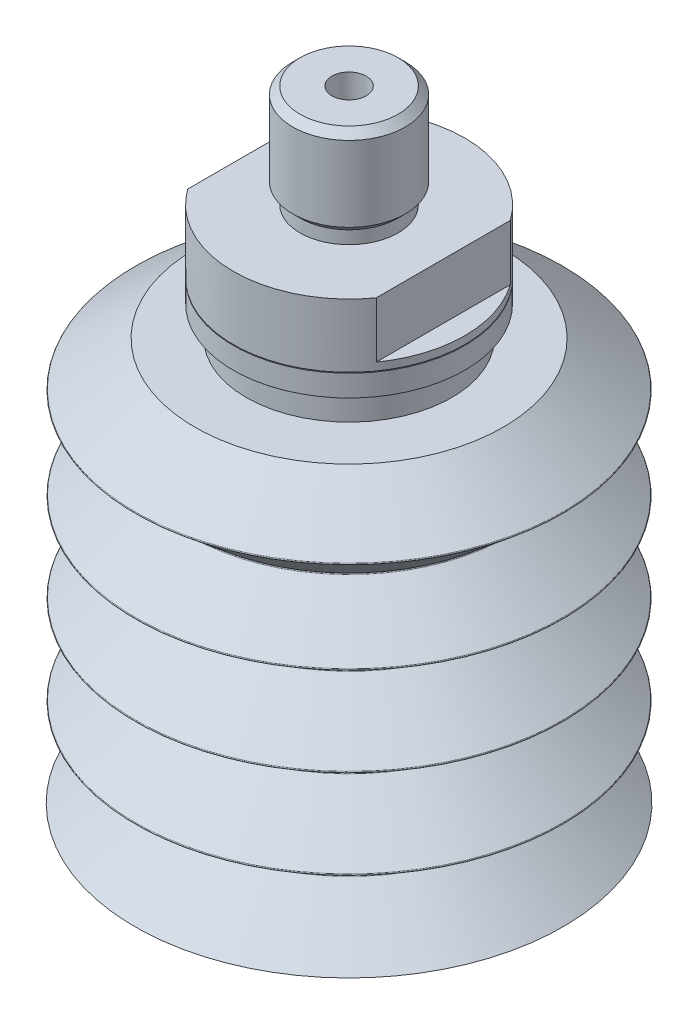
ISO-10303-21;
HEADER;
FILE_DESCRIPTION(('STEP AP214'),'2;1');
FILE_NAME('part.step','',(''),(''),'','','');
FILE_SCHEMA(('AUTOMOTIVE_DESIGN { 1 0 10303 214 1 1 1 1 }'));
ENDSEC;
DATA;
#1=APPLICATION_CONTEXT('core data for automotive mechanical design processes');
#2=APPLICATION_PROTOCOL_DEFINITION('international standard','automotive_design',2000,#1);
#3=PRODUCT_CONTEXT('',#1,'mechanical');
#4=PRODUCT('Part','Part','',(#3));
#5=PRODUCT_RELATED_PRODUCT_CATEGORY('part','',(#4));
#6=PRODUCT_DEFINITION_FORMATION('','',#4);
#7=PRODUCT_DEFINITION_CONTEXT('part definition',#1,'design');
#8=PRODUCT_DEFINITION('design','',#6,#7);
#9=PRODUCT_DEFINITION_SHAPE('','',#8);
#10=(LENGTH_UNIT() NAMED_UNIT(*) SI_UNIT(.MILLI.,.METRE.));
#11=(NAMED_UNIT(*) PLANE_ANGLE_UNIT() SI_UNIT($,.RADIAN.));
#12=(NAMED_UNIT(*) SI_UNIT($,.STERADIAN.) SOLID_ANGLE_UNIT());
#13=UNCERTAINTY_MEASURE_WITH_UNIT(LENGTH_MEASURE(1.E-05),#10,'distance_accuracy_value','');
#14=(GEOMETRIC_REPRESENTATION_CONTEXT(3) GLOBAL_UNCERTAINTY_ASSIGNED_CONTEXT((#13)) GLOBAL_UNIT_ASSIGNED_CONTEXT((#10,
#11,#12)) REPRESENTATION_CONTEXT('',''));
#15=CARTESIAN_POINT('',(0.,0.,0.));
#16=DIRECTION('',(0.,0.,1.));
#17=DIRECTION('',(1.,0.,0.));
#18=AXIS2_PLACEMENT_3D('',#15,#16,#17);
#19=CARTESIAN_POINT('',(-11.,61.5,-14.));
#20=DIRECTION('',(1.,0.,0.));
#21=DIRECTION('',(0.,1.,0.));
#22=AXIS2_PLACEMENT_3D('',#19,#20,#21);
#23=PLANE('',#22);
#24=DIRECTION('',(0.,1.,0.));
#25=VECTOR('',#24,1.);
#26=CARTESIAN_POINT('',(-11.,53.,7.82623792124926));
#27=LINE('',#26,#25);
#28=CARTESIAN_POINT('',(-11.,54.,7.82623792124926));
#29=VERTEX_POINT('',#28);
#30=CARTESIAN_POINT('',(-11.,60.5,7.82623792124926));
#31=VERTEX_POINT('',#30);
#32=EDGE_CURVE('E273',#29,#31,#27,.T.);
#33=ORIENTED_EDGE('',*,*,#32,.T.);
#34=DIRECTION('',(0.,0.,-1.));
#35=VECTOR('',#34,1.);
#36=CARTESIAN_POINT('',(-11.,60.5,0.));
#37=LINE('',#36,#35);
#38=CARTESIAN_POINT('',(-11.,60.5,-7.82623792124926));
#39=VERTEX_POINT('',#38);
#40=EDGE_CURVE('E297',#31,#39,#37,.T.);
#41=ORIENTED_EDGE('',*,*,#40,.T.);
#42=DIRECTION('',(0.,-1.,0.));
#43=VECTOR('',#42,1.);
#44=CARTESIAN_POINT('',(-11.,53.,-7.82623792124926));
#45=LINE('',#44,#43);
#46=CARTESIAN_POINT('',(-11.,54.,-7.82623792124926));
#47=VERTEX_POINT('',#46);
#48=EDGE_CURVE('E245',#39,#47,#45,.T.);
#49=ORIENTED_EDGE('',*,*,#48,.T.);
#50=DIRECTION('',(0.,0.,1.));
#51=VECTOR('',#50,1.);
#52=CARTESIAN_POINT('',(-11.,54.,-14.));
#53=LINE('',#52,#51);
#54=EDGE_CURVE('E10',#47,#29,#53,.T.);
#55=ORIENTED_EDGE('',*,*,#54,.T.);
#56=EDGE_LOOP('',(#33,#41,#49,#55));
#57=FACE_BOUND('',#56,.T.);
#58=ADVANCED_FACE('F15',(#57),#23,.F.);
#59=CARTESIAN_POINT('',(0.,54.,0.));
#60=DIRECTION('',(0.,1.,0.));
#61=DIRECTION('',(1.,0.,0.));
#62=AXIS2_PLACEMENT_3D('',#59,#60,#61);
#63=PLANE('',#62);
#64=ORIENTED_EDGE('',*,*,#54,.F.);
#65=CARTESIAN_POINT('',(0.,54.,0.));
#66=DIRECTION('',(0.,-1.,0.));
#67=DIRECTION('',(0.,0.,1.));
#68=AXIS2_PLACEMENT_3D('',#65,#66,#67);
#69=CIRCLE('',#68,13.5);
#70=EDGE_CURVE('E277',#29,#47,#69,.T.);
#71=ORIENTED_EDGE('',*,*,#70,.F.);
#72=EDGE_LOOP('',(#64,#71));
#73=FACE_BOUND('',#72,.T.);
#74=ADVANCED_FACE('F435',(#73),#63,.T.);
#75=CARTESIAN_POINT('',(0.,54.,0.));
#76=DIRECTION('',(0.,1.,0.));
#77=DIRECTION('',(1.,0.,0.));
#78=AXIS2_PLACEMENT_3D('',#75,#76,#77);
#79=PLANE('',#78);
#80=DIRECTION('',(0.,0.,-1.));
#81=VECTOR('',#80,1.);
#82=CARTESIAN_POINT('',(11.,54.,14.));
#83=LINE('',#82,#81);
#84=CARTESIAN_POINT('',(11.,54.,7.82623792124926));
#85=VERTEX_POINT('',#84);
#86=CARTESIAN_POINT('',(11.,54.,-7.82623792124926));
#87=VERTEX_POINT('',#86);
#88=EDGE_CURVE('E26',#85,#87,#83,.T.);
#89=ORIENTED_EDGE('',*,*,#88,.F.);
#90=CARTESIAN_POINT('',(0.,54.,0.));
#91=DIRECTION('',(0.,-1.,0.));
#92=DIRECTION('',(0.,0.,1.));
#93=AXIS2_PLACEMENT_3D('',#90,#91,#92);
#94=CIRCLE('',#93,13.5);
#95=EDGE_CURVE('E267',#87,#85,#94,.T.);
#96=ORIENTED_EDGE('',*,*,#95,.F.);
#97=EDGE_LOOP('',(#89,#96));
#98=FACE_BOUND('',#97,.T.);
#99=ADVANCED_FACE('F441',(#98),#79,.T.);
#100=CARTESIAN_POINT('',(11.,61.5,14.));
#101=DIRECTION('',(-1.,0.,0.));
#102=DIRECTION('',(0.,0.,1.));
#103=AXIS2_PLACEMENT_3D('',#100,#101,#102);
#104=PLANE('',#103);
#105=DIRECTION('',(0.,1.,0.));
#106=VECTOR('',#105,1.);
#107=CARTESIAN_POINT('',(11.,53.,-7.82623792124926));
#108=LINE('',#107,#106);
#109=CARTESIAN_POINT('',(11.,60.5,-7.82623792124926));
#110=VERTEX_POINT('',#109);
#111=EDGE_CURVE('E304',#87,#110,#108,.T.);
#112=ORIENTED_EDGE('',*,*,#111,.T.);
#113=DIRECTION('',(0.,0.,1.));
#114=VECTOR('',#113,1.);
#115=CARTESIAN_POINT('',(11.,60.5,0.));
#116=LINE('',#115,#114);
#117=CARTESIAN_POINT('',(11.,60.5,7.82623792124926));
#118=VERTEX_POINT('',#117);
#119=EDGE_CURVE('E292',#110,#118,#116,.T.);
#120=ORIENTED_EDGE('',*,*,#119,.T.);
#121=DIRECTION('',(0.,-1.,0.));
#122=VECTOR('',#121,1.);
#123=CARTESIAN_POINT('',(11.,53.,7.82623792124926));
#124=LINE('',#123,#122);
#125=EDGE_CURVE('E262',#118,#85,#124,.T.);
#126=ORIENTED_EDGE('',*,*,#125,.T.);
#127=ORIENTED_EDGE('',*,*,#88,.T.);
#128=EDGE_LOOP('',(#112,#120,#126,#127));
#129=FACE_BOUND('',#128,.T.);
#130=ADVANCED_FACE('F429',(#129),#104,.F.);
#131=CARTESIAN_POINT('',(0.,71.644,0.));
#132=DIRECTION('',(0.,-1.,0.));
#133=DIRECTION('',(0.,0.,-1.));
#134=AXIS2_PLACEMENT_3D('',#131,#132,#133);
#135=CONICAL_SURFACE('',#134,6.5785,0.785398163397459);
#136=CARTESIAN_POINT('',(0.,71.644,0.));
#137=DIRECTION('',(0.,-1.,0.));
#138=DIRECTION('',(0.,0.,-1.));
#139=AXIS2_PLACEMENT_3D('',#136,#137,#138);
#140=CIRCLE('',#139,6.5785);
#141=CARTESIAN_POINT('',(0.,71.644,-6.5785));
#142=VERTEX_POINT('',#141);
#143=EDGE_CURVE('E38',#142,#142,#140,.T.);
#144=ORIENTED_EDGE('',*,*,#143,.F.);
#145=EDGE_LOOP('',(#144));
#146=FACE_BOUND('',#145,.T.);
#147=CARTESIAN_POINT('',(0.,72.5,0.));
#148=DIRECTION('',(0.,-1.,0.));
#149=DIRECTION('',(0.,0.,-1.));
#150=AXIS2_PLACEMENT_3D('',#147,#148,#149);
#151=CIRCLE('',#150,5.7225);
#152=CARTESIAN_POINT('',(0.,72.5,-5.7225));
#153=VERTEX_POINT('',#152);
#154=EDGE_CURVE('E286',#153,#153,#151,.T.);
#155=ORIENTED_EDGE('',*,*,#154,.T.);
#156=EDGE_LOOP('',(#155));
#157=FACE_BOUND('',#156,.T.);
#158=ADVANCED_FACE('F419',(#146,#157),#135,.T.);
#159=CARTESIAN_POINT('',(0.,53.,0.));
#160=DIRECTION('',(0.,-1.,0.));
#161=DIRECTION('',(0.,0.,-1.));
#162=AXIS2_PLACEMENT_3D('',#159,#160,#161);
#163=CYLINDRICAL_SURFACE('',#162,6.5785);
#164=CARTESIAN_POINT('',(0.,62.856,0.));
#165=DIRECTION('',(0.,-1.,0.));
#166=DIRECTION('',(0.,0.,-1.));
#167=AXIS2_PLACEMENT_3D('',#164,#165,#166);
#168=CIRCLE('',#167,6.5785);
#169=CARTESIAN_POINT('',(0.,62.856,-6.5785));
#170=VERTEX_POINT('',#169);
#171=EDGE_CURVE('E313',#170,#170,#168,.T.);
#172=ORIENTED_EDGE('',*,*,#171,.F.);
#173=EDGE_LOOP('',(#172));
#174=FACE_BOUND('',#173,.T.);
#175=ORIENTED_EDGE('',*,*,#143,.T.);
#176=EDGE_LOOP('',(#175));
#177=FACE_BOUND('',#176,.T.);
#178=ADVANCED_FACE('F417',(#174,#177),#163,.T.);
#179=CARTESIAN_POINT('',(0.,62.,0.));
#180=DIRECTION('',(0.,1.,0.));
#181=DIRECTION('',(0.,0.,1.));
#182=AXIS2_PLACEMENT_3D('',#179,#180,#181);
#183=CONICAL_SURFACE('',#182,5.7225,0.785398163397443);
#184=CARTESIAN_POINT('',(0.,62.,0.));
#185=DIRECTION('',(0.,-1.,0.));
#186=DIRECTION('',(0.,0.,-1.));
#187=AXIS2_PLACEMENT_3D('',#184,#185,#186);
#188=CIRCLE('',#187,5.7225);
#189=CARTESIAN_POINT('',(0.,62.,-5.7225));
#190=VERTEX_POINT('',#189);
#191=EDGE_CURVE('E296',#190,#190,#188,.T.);
#192=ORIENTED_EDGE('',*,*,#191,.F.);
#193=EDGE_LOOP('',(#192));
#194=FACE_BOUND('',#193,.T.);
#195=ORIENTED_EDGE('',*,*,#171,.T.);
#196=EDGE_LOOP('',(#195));
#197=FACE_BOUND('',#196,.T.);
#198=ADVANCED_FACE('F415',(#194,#197),#183,.T.);
#199=CARTESIAN_POINT('',(0.,53.,0.));
#200=DIRECTION('',(0.,-1.,0.));
#201=DIRECTION('',(0.,0.,-1.));
#202=AXIS2_PLACEMENT_3D('',#199,#200,#201);
#203=CYLINDRICAL_SURFACE('',#202,5.7225);
#204=CARTESIAN_POINT('',(0.,60.5,0.));
#205=DIRECTION('',(0.,-1.,0.));
#206=DIRECTION('',(0.,0.,-1.));
#207=AXIS2_PLACEMENT_3D('',#204,#205,#206);
#208=CIRCLE('',#207,5.7225);
#209=CARTESIAN_POINT('',(0.,60.5,-5.7225));
#210=VERTEX_POINT('',#209);
#211=EDGE_CURVE('E244',#210,#210,#208,.T.);
#212=ORIENTED_EDGE('',*,*,#211,.F.);
#213=EDGE_LOOP('',(#212));
#214=FACE_BOUND('',#213,.T.);
#215=ORIENTED_EDGE('',*,*,#191,.T.);
#216=EDGE_LOOP('',(#215));
#217=FACE_BOUND('',#216,.T.);
#218=ADVANCED_FACE('F426',(#214,#217),#203,.T.);
#219=CARTESIAN_POINT('',(13.5,60.5,0.));
#220=DIRECTION('',(0.,1.,0.));
#221=DIRECTION('',(1.,0.,0.));
#222=AXIS2_PLACEMENT_3D('',#219,#220,#221);
#223=PLANE('',#222);
#224=ORIENTED_EDGE('',*,*,#40,.F.);
#225=CARTESIAN_POINT('',(0.,60.5,0.));
#226=DIRECTION('',(0.,-1.,0.));
#227=DIRECTION('',(0.,0.,-1.));
#228=AXIS2_PLACEMENT_3D('',#225,#226,#227);
#229=CIRCLE('',#228,13.5);
#230=EDGE_CURVE('E266',#118,#31,#229,.T.);
#231=ORIENTED_EDGE('',*,*,#230,.F.);
#232=ORIENTED_EDGE('',*,*,#119,.F.);
#233=CARTESIAN_POINT('',(0.,60.5,0.));
#234=DIRECTION('',(0.,-1.,0.));
#235=DIRECTION('',(0.,0.,-1.));
#236=AXIS2_PLACEMENT_3D('',#233,#234,#235);
#237=CIRCLE('',#236,13.5);
#238=EDGE_CURVE('E240',#39,#110,#237,.T.);
#239=ORIENTED_EDGE('',*,*,#238,.F.);
#240=EDGE_LOOP('',(#224,#231,#232,#239));
#241=FACE_BOUND('',#240,.T.);
#242=ORIENTED_EDGE('',*,*,#211,.T.);
#243=EDGE_LOOP('',(#242));
#244=FACE_BOUND('',#243,.T.);
#245=ADVANCED_FACE('F528',(#241,#244),#223,.T.);
#246=CARTESIAN_POINT('',(0.,53.,0.));
#247=DIRECTION('',(0.,-1.,0.));
#248=DIRECTION('',(0.,0.,-1.));
#249=AXIS2_PLACEMENT_3D('',#246,#247,#248);
#250=CYLINDRICAL_SURFACE('',#249,13.5);
#251=CARTESIAN_POINT('',(0.,53.1,0.));
#252=DIRECTION('',(0.,-1.,0.));
#253=DIRECTION('',(0.,0.,-1.));
#254=AXIS2_PLACEMENT_3D('',#251,#252,#253);
#255=CIRCLE('',#254,13.5);
#256=CARTESIAN_POINT('',(0.,53.1,-13.5));
#257=VERTEX_POINT('',#256);
#258=EDGE_CURVE('E290',#257,#257,#255,.T.);
#259=ORIENTED_EDGE('',*,*,#258,.F.);
#260=EDGE_LOOP('',(#259));
#261=FACE_BOUND('',#260,.T.);
#262=ORIENTED_EDGE('',*,*,#111,.F.);
#263=ORIENTED_EDGE('',*,*,#95,.T.);
#264=ORIENTED_EDGE('',*,*,#125,.F.);
#265=ORIENTED_EDGE('',*,*,#230,.T.);
#266=ORIENTED_EDGE('',*,*,#32,.F.);
#267=ORIENTED_EDGE('',*,*,#70,.T.);
#268=ORIENTED_EDGE('',*,*,#48,.F.);
#269=ORIENTED_EDGE('',*,*,#238,.T.);
#270=EDGE_LOOP('',(#262,#263,#264,#265,#266,#267,#268,#269));
#271=FACE_BOUND('',#270,.T.);
#272=ADVANCED_FACE('F517',(#261,#271),#250,.T.);
#273=CARTESIAN_POINT('',(0.,53.,0.));
#274=DIRECTION('',(0.,1.,0.));
#275=DIRECTION('',(0.,0.,1.));
#276=AXIS2_PLACEMENT_3D('',#273,#274,#275);
#277=CONICAL_SURFACE('',#276,13.4,0.785398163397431);
#278=CARTESIAN_POINT('',(0.,53.,0.));
#279=DIRECTION('',(0.,-1.,0.));
#280=DIRECTION('',(0.,0.,-1.));
#281=AXIS2_PLACEMENT_3D('',#278,#279,#280);
#282=CIRCLE('',#281,13.4);
#283=CARTESIAN_POINT('',(0.,53.,-13.4));
#284=VERTEX_POINT('',#283);
#285=EDGE_CURVE('E281',#284,#284,#282,.T.);
#286=ORIENTED_EDGE('',*,*,#285,.F.);
#287=EDGE_LOOP('',(#286));
#288=FACE_BOUND('',#287,.T.);
#289=ORIENTED_EDGE('',*,*,#258,.T.);
#290=EDGE_LOOP('',(#289));
#291=FACE_BOUND('',#290,.T.);
#292=ADVANCED_FACE('F513',(#288,#291),#277,.T.);
#293=CARTESIAN_POINT('',(0.,53.,0.));
#294=DIRECTION('',(0.,-1.,0.));
#295=DIRECTION('',(0.,0.,-1.));
#296=AXIS2_PLACEMENT_3D('',#293,#294,#295);
#297=CYLINDRICAL_SURFACE('',#296,2.);
#298=CARTESIAN_POINT('',(0.,72.5,0.));
#299=DIRECTION('',(0.,-1.,0.));
#300=DIRECTION('',(0.,0.,-1.));
#301=AXIS2_PLACEMENT_3D('',#298,#299,#300);
#302=CIRCLE('',#301,2.);
#303=CARTESIAN_POINT('',(0.,72.5,-2.));
#304=VERTEX_POINT('',#303);
#305=EDGE_CURVE('E291',#304,#304,#302,.T.);
#306=ORIENTED_EDGE('',*,*,#305,.F.);
#307=EDGE_LOOP('',(#306));
#308=FACE_BOUND('',#307,.T.);
#309=CARTESIAN_POINT('',(0.,53.,0.));
#310=DIRECTION('',(0.,-1.,0.));
#311=DIRECTION('',(0.,0.,-1.));
#312=AXIS2_PLACEMENT_3D('',#309,#310,#311);
#313=CIRCLE('',#312,2.);
#314=CARTESIAN_POINT('',(0.,53.,-2.));
#315=VERTEX_POINT('',#314);
#316=EDGE_CURVE('E360',#315,#315,#313,.T.);
#317=ORIENTED_EDGE('',*,*,#316,.T.);
#318=EDGE_LOOP('',(#317));
#319=FACE_BOUND('',#318,.T.);
#320=ADVANCED_FACE('F516',(#308,#319),#297,.F.);
#321=CARTESIAN_POINT('',(5.7225,72.5,0.));
#322=DIRECTION('',(0.,1.,0.));
#323=DIRECTION('',(1.,0.,0.));
#324=AXIS2_PLACEMENT_3D('',#321,#322,#323);
#325=PLANE('',#324);
#326=ORIENTED_EDGE('',*,*,#154,.F.);
#327=EDGE_LOOP('',(#326));
#328=FACE_BOUND('',#327,.T.);
#329=ORIENTED_EDGE('',*,*,#305,.T.);
#330=EDGE_LOOP('',(#329));
#331=FACE_BOUND('',#330,.T.);
#332=ADVANCED_FACE('F759',(#328,#331),#325,.T.);
#333=CARTESIAN_POINT('',(2.,53.,0.));
#334=DIRECTION('',(0.,-1.,0.));
#335=DIRECTION('',(0.,0.,-1.));
#336=AXIS2_PLACEMENT_3D('',#333,#334,#335);
#337=PLANE('',#336);
#338=ORIENTED_EDGE('',*,*,#316,.F.);
#339=EDGE_LOOP('',(#338));
#340=FACE_BOUND('',#339,.T.);
#341=CARTESIAN_POINT('',(0.,53.,0.));
#342=DIRECTION('',(0.,-1.,0.));
#343=DIRECTION('',(0.,0.,-1.));
#344=AXIS2_PLACEMENT_3D('',#341,#342,#343);
#345=CIRCLE('',#344,5.25);
#346=CARTESIAN_POINT('',(0.,53.,-5.25));
#347=VERTEX_POINT('',#346);
#348=EDGE_CURVE('E374',#347,#347,#345,.T.);
#349=ORIENTED_EDGE('',*,*,#348,.T.);
#350=EDGE_LOOP('',(#349));
#351=FACE_BOUND('',#350,.T.);
#352=ADVANCED_FACE('F605',(#340,#351),#337,.T.);
#353=CARTESIAN_POINT('',(0.,0.,0.));
#354=DIRECTION('',(0.,-1.,0.));
#355=DIRECTION('',(0.,0.,-1.));
#356=AXIS2_PLACEMENT_3D('',#353,#354,#355);
#357=CYLINDRICAL_SURFACE('',#356,5.25);
#358=ORIENTED_EDGE('',*,*,#348,.F.);
#359=EDGE_LOOP('',(#358));
#360=FACE_BOUND('',#359,.T.);
#361=CARTESIAN_POINT('',(0.,50.5,0.));
#362=DIRECTION('',(0.,-1.,0.));
#363=DIRECTION('',(0.,0.,-1.));
#364=AXIS2_PLACEMENT_3D('',#361,#362,#363);
#365=CIRCLE('',#364,5.25);
#366=CARTESIAN_POINT('',(0.,50.5,-5.25));
#367=VERTEX_POINT('',#366);
#368=EDGE_CURVE('E221',#367,#367,#365,.T.);
#369=ORIENTED_EDGE('',*,*,#368,.T.);
#370=EDGE_LOOP('',(#369));
#371=FACE_BOUND('',#370,.T.);
#372=ADVANCED_FACE('F507',(#360,#371),#357,.F.);
#373=CARTESIAN_POINT('',(13.5,53.,0.));
#374=DIRECTION('',(0.,1.,0.));
#375=DIRECTION('',(1.,0.,0.));
#376=AXIS2_PLACEMENT_3D('',#373,#374,#375);
#377=PLANE('',#376);
#378=CARTESIAN_POINT('',(0.,53.,0.));
#379=DIRECTION('',(0.,-1.,0.));
#380=DIRECTION('',(0.,0.,-1.));
#381=AXIS2_PLACEMENT_3D('',#378,#379,#380);
#382=CIRCLE('',#381,13.5);
#383=CARTESIAN_POINT('',(0.,53.,-13.5));
#384=VERTEX_POINT('',#383);
#385=EDGE_CURVE('E278',#384,#384,#382,.T.);
#386=ORIENTED_EDGE('',*,*,#385,.F.);
#387=EDGE_LOOP('',(#386));
#388=FACE_BOUND('',#387,.T.);
#389=ORIENTED_EDGE('',*,*,#285,.T.);
#390=EDGE_LOOP('',(#389));
#391=FACE_BOUND('',#390,.T.);
#392=ADVANCED_FACE('F501',(#388,#391),#377,.T.);
#393=CARTESIAN_POINT('',(0.,0.,0.));
#394=DIRECTION('',(0.,-1.,0.));
#395=DIRECTION('',(0.,0.,-1.));
#396=AXIS2_PLACEMENT_3D('',#393,#394,#395);
#397=CYLINDRICAL_SURFACE('',#396,13.5);
#398=CARTESIAN_POINT('',(0.,50.5,0.));
#399=DIRECTION('',(0.,-1.,0.));
#400=DIRECTION('',(0.,0.,-1.));
#401=AXIS2_PLACEMENT_3D('',#398,#399,#400);
#402=CIRCLE('',#401,13.5);
#403=CARTESIAN_POINT('',(0.,50.5,-13.5));
#404=VERTEX_POINT('',#403);
#405=EDGE_CURVE('E282',#404,#404,#402,.T.);
#406=ORIENTED_EDGE('',*,*,#405,.F.);
#407=EDGE_LOOP('',(#406));
#408=FACE_BOUND('',#407,.T.);
#409=ORIENTED_EDGE('',*,*,#385,.T.);
#410=EDGE_LOOP('',(#409));
#411=FACE_BOUND('',#410,.T.);
#412=ADVANCED_FACE('F493',(#408,#411),#397,.T.);
#413=CARTESIAN_POINT('',(12.,50.5,0.));
#414=DIRECTION('',(0.,-1.,0.));
#415=DIRECTION('',(0.,0.,-1.));
#416=AXIS2_PLACEMENT_3D('',#413,#414,#415);
#417=PLANE('',#416);
#418=CARTESIAN_POINT('',(0.,50.5,0.));
#419=DIRECTION('',(0.,-1.,0.));
#420=DIRECTION('',(0.,0.,-1.));
#421=AXIS2_PLACEMENT_3D('',#418,#419,#420);
#422=CIRCLE('',#421,12.);
#423=CARTESIAN_POINT('',(0.,50.5,-12.));
#424=VERTEX_POINT('',#423);
#425=EDGE_CURVE('E323',#424,#424,#422,.T.);
#426=ORIENTED_EDGE('',*,*,#425,.F.);
#427=EDGE_LOOP('',(#426));
#428=FACE_BOUND('',#427,.T.);
#429=ORIENTED_EDGE('',*,*,#405,.T.);
#430=EDGE_LOOP('',(#429));
#431=FACE_BOUND('',#430,.T.);
#432=ADVANCED_FACE('F487',(#428,#431),#417,.T.);
#433=CARTESIAN_POINT('',(0.,0.,0.));
#434=DIRECTION('',(0.,-1.,0.));
#435=DIRECTION('',(0.,0.,-1.));
#436=AXIS2_PLACEMENT_3D('',#433,#434,#435);
#437=CYLINDRICAL_SURFACE('',#436,12.);
#438=CARTESIAN_POINT('',(0.,47.,0.));
#439=DIRECTION('',(0.,-1.,0.));
#440=DIRECTION('',(0.,0.,-1.));
#441=AXIS2_PLACEMENT_3D('',#438,#439,#440);
#442=CIRCLE('',#441,12.);
#443=CARTESIAN_POINT('',(0.,47.,-12.));
#444=VERTEX_POINT('',#443);
#445=EDGE_CURVE('E326',#444,#444,#442,.T.);
#446=ORIENTED_EDGE('',*,*,#445,.F.);
#447=EDGE_LOOP('',(#446));
#448=FACE_BOUND('',#447,.T.);
#449=ORIENTED_EDGE('',*,*,#425,.T.);
#450=EDGE_LOOP('',(#449));
#451=FACE_BOUND('',#450,.T.);
#452=ADVANCED_FACE('F481',(#448,#451),#437,.T.);
#453=CARTESIAN_POINT('',(18.,47.,0.));
#454=DIRECTION('',(0.,1.,0.));
#455=DIRECTION('',(1.,0.,0.));
#456=AXIS2_PLACEMENT_3D('',#453,#454,#455);
#457=PLANE('',#456);
#458=CARTESIAN_POINT('',(0.,47.,0.));
#459=DIRECTION('',(0.,-1.,0.));
#460=DIRECTION('',(0.,0.,-1.));
#461=AXIS2_PLACEMENT_3D('',#458,#459,#460);
#462=CIRCLE('',#461,18.);
#463=CARTESIAN_POINT('',(0.,47.,-18.));
#464=VERTEX_POINT('',#463);
#465=EDGE_CURVE('E19',#464,#464,#462,.T.);
#466=ORIENTED_EDGE('',*,*,#465,.F.);
#467=EDGE_LOOP('',(#466));
#468=FACE_BOUND('',#467,.T.);
#469=ORIENTED_EDGE('',*,*,#445,.T.);
#470=EDGE_LOOP('',(#469));
#471=FACE_BOUND('',#470,.T.);
#472=ADVANCED_FACE('F463',(#468,#471),#457,.T.);
#473=CARTESIAN_POINT('',(0.,41.8675539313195,0.));
#474=DIRECTION('',(0.,-1.,0.));
#475=DIRECTION('',(0.,0.,-1.));
#476=AXIS2_PLACEMENT_3D('',#473,#474,#475);
#477=CONICAL_SURFACE('',#476,24.8984996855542,0.931149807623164);
#478=CARTESIAN_POINT('',(0.,41.8675539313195,0.));
#479=DIRECTION('',(0.,-1.,0.));
#480=DIRECTION('',(0.,0.,-1.));
#481=AXIS2_PLACEMENT_3D('',#478,#479,#480);
#482=CIRCLE('',#481,24.8984996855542);
#483=CARTESIAN_POINT('',(0.,41.8675539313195,-24.8984996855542));
#484=VERTEX_POINT('',#483);
#485=EDGE_CURVE('E212',#484,#484,#482,.T.);
#486=ORIENTED_EDGE('',*,*,#485,.F.);
#487=EDGE_LOOP('',(#486));
#488=FACE_BOUND('',#487,.T.);
#489=ORIENTED_EDGE('',*,*,#465,.T.);
#490=EDGE_LOOP('',(#489));
#491=FACE_BOUND('',#490,.T.);
#492=ADVANCED_FACE('F454',(#488,#491),#477,.T.);
#493=CARTESIAN_POINT('',(0.,41.7873232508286,0.));
#494=DIRECTION('',(0.,-1.,0.));
#495=DIRECTION('',(0.,0.,-1.));
#496=AXIS2_PLACEMENT_3D('',#493,#494,#495);
#497=TOROIDAL_SURFACE('',#496,24.8388084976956,0.100000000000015);
#498=CARTESIAN_POINT('',(0.,41.7107188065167,0.));
#499=DIRECTION('',(0.,-1.,0.));
#500=DIRECTION('',(0.,0.,-1.));
#501=AXIS2_PLACEMENT_3D('',#498,#499,#500);
#502=CIRCLE('',#501,24.9030872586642);
#503=CARTESIAN_POINT('',(0.,41.7107188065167,-24.9030872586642));
#504=VERTEX_POINT('',#503);
#505=EDGE_CURVE('E238',#504,#504,#502,.T.);
#506=ORIENTED_EDGE('',*,*,#505,.F.);
#507=EDGE_LOOP('',(#506));
#508=FACE_BOUND('',#507,.T.);
#509=ORIENTED_EDGE('',*,*,#485,.T.);
#510=EDGE_LOOP('',(#509));
#511=FACE_BOUND('',#510,.T.);
#512=ADVANCED_FACE('F451',(#508,#511),#497,.T.);
#513=CARTESIAN_POINT('',(0.,36.3405360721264,0.));
#514=DIRECTION('',(0.,1.,0.));
#515=DIRECTION('',(0.,0.,1.));
#516=AXIS2_PLACEMENT_3D('',#513,#514,#515);
#517=CONICAL_SURFACE('',#516,18.5031526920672,0.872664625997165);
#518=CARTESIAN_POINT('',(0.,36.3405360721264,0.));
#519=DIRECTION('',(0.,-1.,0.));
#520=DIRECTION('',(0.,0.,-1.));
#521=AXIS2_PLACEMENT_3D('',#518,#519,#520);
#522=CIRCLE('',#521,18.5031526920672);
#523=CARTESIAN_POINT('',(0.,36.3405360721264,-18.5031526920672));
#524=VERTEX_POINT('',#523);
#525=EDGE_CURVE('E235',#524,#524,#522,.T.);
#526=ORIENTED_EDGE('',*,*,#525,.F.);
#527=EDGE_LOOP('',(#526));
#528=FACE_BOUND('',#527,.T.);
#529=ORIENTED_EDGE('',*,*,#505,.T.);
#530=EDGE_LOOP('',(#529));
#531=FACE_BOUND('',#530,.T.);
#532=ADVANCED_FACE('F453',(#528,#531),#517,.T.);
#533=CARTESIAN_POINT('',(0.,36.2639316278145,0.));
#534=DIRECTION('',(0.,-1.,0.));
#535=DIRECTION('',(0.,0.,-1.));
#536=AXIS2_PLACEMENT_3D('',#533,#534,#535);
#537=TOROIDAL_SURFACE('',#536,18.5674314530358,0.0999999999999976);
#538=ORIENTED_EDGE('',*,*,#525,.T.);
#539=EDGE_LOOP('',(#538));
#540=FACE_BOUND('',#539,.T.);
#541=CARTESIAN_POINT('',(0.,36.1851305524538,0.));
#542=DIRECTION('',(0.,-1.,0.));
#543=DIRECTION('',(0.,0.,-1.));
#544=AXIS2_PLACEMENT_3D('',#541,#542,#543);
#545=CIRCLE('',#544,18.5058653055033);
#546=CARTESIAN_POINT('',(0.,36.1851305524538,-18.5058653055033));
#547=VERTEX_POINT('',#546);
#548=EDGE_CURVE('E239',#547,#547,#545,.T.);
#549=ORIENTED_EDGE('',*,*,#548,.F.);
#550=EDGE_LOOP('',(#549));
#551=FACE_BOUND('',#550,.T.);
#552=ADVANCED_FACE('F460',(#540,#551),#537,.F.);
#553=CARTESIAN_POINT('',(0.,31.1945583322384,0.));
#554=DIRECTION('',(0.,-1.,0.));
#555=DIRECTION('',(0.,0.,-1.));
#556=AXIS2_PLACEMENT_3D('',#553,#554,#555);
#557=CONICAL_SURFACE('',#556,24.8935064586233,0.907571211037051);
#558=CARTESIAN_POINT('',(0.,31.1945583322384,0.));
#559=DIRECTION('',(0.,-1.,0.));
#560=DIRECTION('',(0.,0.,-1.));
#561=AXIS2_PLACEMENT_3D('',#558,#559,#560);
#562=CIRCLE('',#561,24.8935064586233);
#563=CARTESIAN_POINT('',(0.,31.1945583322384,-24.8935064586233));
#564=VERTEX_POINT('',#563);
#565=EDGE_CURVE('E305',#564,#564,#562,.T.);
#566=ORIENTED_EDGE('',*,*,#565,.F.);
#567=EDGE_LOOP('',(#566));
#568=FACE_BOUND('',#567,.T.);
#569=ORIENTED_EDGE('',*,*,#548,.T.);
#570=EDGE_LOOP('',(#569));
#571=FACE_BOUND('',#570,.T.);
#572=ADVANCED_FACE('F639',(#568,#571),#557,.T.);
#573=CARTESIAN_POINT('',(0.,31.1157572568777,0.));
#574=DIRECTION('',(0.,-1.,0.));
#575=DIRECTION('',(0.,0.,-1.));
#576=AXIS2_PLACEMENT_3D('',#573,#574,#575);
#577=TOROIDAL_SURFACE('',#576,24.8319403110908,0.1);
#578=CARTESIAN_POINT('',(0.,31.0338420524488,0.));
#579=DIRECTION('',(0.,-1.,0.));
#580=DIRECTION('',(0.,0.,-1.));
#581=AXIS2_PLACEMENT_3D('',#578,#579,#580);
#582=CIRCLE('',#581,24.8892979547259);
#583=CARTESIAN_POINT('',(0.,31.0338420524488,-24.8892979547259));
#584=VERTEX_POINT('',#583);
#585=EDGE_CURVE('E271',#584,#584,#582,.T.);
#586=ORIENTED_EDGE('',*,*,#585,.F.);
#587=EDGE_LOOP('',(#586));
#588=FACE_BOUND('',#587,.T.);
#589=ORIENTED_EDGE('',*,*,#565,.T.);
#590=EDGE_LOOP('',(#589));
#591=FACE_BOUND('',#590,.T.);
#592=ADVANCED_FACE('F647',(#588,#591),#577,.T.);
#593=CARTESIAN_POINT('',(0.,26.2874180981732,0.));
#594=DIRECTION('',(0.,1.,0.));
#595=DIRECTION('',(0.,0.,1.));
#596=AXIS2_PLACEMENT_3D('',#593,#594,#595);
#597=CONICAL_SURFACE('',#596,18.1107020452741,0.959931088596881);
#598=CARTESIAN_POINT('',(0.,26.2874180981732,0.));
#599=DIRECTION('',(0.,-1.,0.));
#600=DIRECTION('',(0.,0.,-1.));
#601=AXIS2_PLACEMENT_3D('',#598,#599,#600);
#602=CIRCLE('',#601,18.1107020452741);
#603=CARTESIAN_POINT('',(0.,26.2874180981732,-18.1107020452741));
#604=VERTEX_POINT('',#603);
#605=EDGE_CURVE('E268',#604,#604,#602,.T.);
#606=ORIENTED_EDGE('',*,*,#605,.F.);
#607=EDGE_LOOP('',(#606));
#608=FACE_BOUND('',#607,.T.);
#609=ORIENTED_EDGE('',*,*,#585,.T.);
#610=EDGE_LOOP('',(#609));
#611=FACE_BOUND('',#610,.T.);
#612=ADVANCED_FACE('F727',(#608,#611),#597,.T.);
#613=CARTESIAN_POINT('',(0.,26.2055028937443,0.));
#614=DIRECTION('',(0.,-1.,0.));
#615=DIRECTION('',(0.,0.,-1.));
#616=AXIS2_PLACEMENT_3D('',#613,#614,#615);
#617=TOROIDAL_SURFACE('',#616,18.1680596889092,0.0999999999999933);
#618=ORIENTED_EDGE('',*,*,#605,.T.);
#619=EDGE_LOOP('',(#618));
#620=FACE_BOUND('',#619,.T.);
#621=CARTESIAN_POINT('',(0.,26.1267018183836,0.));
#622=DIRECTION('',(0.,-1.,0.));
#623=DIRECTION('',(0.,0.,-1.));
#624=AXIS2_PLACEMENT_3D('',#621,#622,#623);
#625=CIRCLE('',#624,18.1064935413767);
#626=CARTESIAN_POINT('',(0.,26.1267018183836,-18.1064935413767));
#627=VERTEX_POINT('',#626);
#628=EDGE_CURVE('E272',#627,#627,#625,.T.);
#629=ORIENTED_EDGE('',*,*,#628,.F.);
#630=EDGE_LOOP('',(#629));
#631=FACE_BOUND('',#630,.T.);
#632=ADVANCED_FACE('F704',(#620,#631),#617,.F.);
#633=CARTESIAN_POINT('',(0.,20.8241061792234,0.));
#634=DIRECTION('',(0.,-1.,0.));
#635=DIRECTION('',(0.,0.,-1.));
#636=AXIS2_PLACEMENT_3D('',#633,#634,#635);
#637=CONICAL_SURFACE('',#636,24.8935064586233,0.907571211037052);
#638=CARTESIAN_POINT('',(0.,20.8241061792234,0.));
#639=DIRECTION('',(0.,-1.,0.));
#640=DIRECTION('',(0.,0.,-1.));
#641=AXIS2_PLACEMENT_3D('',#638,#639,#640);
#642=CIRCLE('',#641,24.8935064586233);
#643=CARTESIAN_POINT('',(0.,20.8241061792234,-24.8935064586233));
#644=VERTEX_POINT('',#643);
#645=EDGE_CURVE('E283',#644,#644,#642,.T.);
#646=ORIENTED_EDGE('',*,*,#645,.F.);
#647=EDGE_LOOP('',(#646));
#648=FACE_BOUND('',#647,.T.);
#649=ORIENTED_EDGE('',*,*,#628,.T.);
#650=EDGE_LOOP('',(#649));
#651=FACE_BOUND('',#650,.T.);
#652=ADVANCED_FACE('F709',(#648,#651),#637,.T.);
#653=CARTESIAN_POINT('',(0.,20.7453051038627,0.));
#654=DIRECTION('',(0.,-1.,0.));
#655=DIRECTION('',(0.,0.,-1.));
#656=AXIS2_PLACEMENT_3D('',#653,#654,#655);
#657=TOROIDAL_SURFACE('',#656,24.8319403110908,0.100000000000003);
#658=CARTESIAN_POINT('',(0.,20.6633898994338,0.));
#659=DIRECTION('',(0.,-1.,0.));
#660=DIRECTION('',(0.,0.,-1.));
#661=AXIS2_PLACEMENT_3D('',#658,#659,#660);
#662=CIRCLE('',#661,24.8892979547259);
#663=CARTESIAN_POINT('',(0.,20.6633898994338,-24.8892979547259));
#664=VERTEX_POINT('',#663);
#665=EDGE_CURVE('E260',#664,#664,#662,.T.);
#666=ORIENTED_EDGE('',*,*,#665,.F.);
#667=EDGE_LOOP('',(#666));
#668=FACE_BOUND('',#667,.T.);
#669=ORIENTED_EDGE('',*,*,#645,.T.);
#670=EDGE_LOOP('',(#669));
#671=FACE_BOUND('',#670,.T.);
#672=ADVANCED_FACE('F706',(#668,#671),#657,.T.);
#673=CARTESIAN_POINT('',(0.,15.9169659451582,0.));
#674=DIRECTION('',(0.,1.,0.));
#675=DIRECTION('',(0.,0.,1.));
#676=AXIS2_PLACEMENT_3D('',#673,#674,#675);
#677=CONICAL_SURFACE('',#676,18.1107020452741,0.959931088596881);
#678=CARTESIAN_POINT('',(0.,15.9169659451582,0.));
#679=DIRECTION('',(0.,-1.,0.));
#680=DIRECTION('',(0.,0.,-1.));
#681=AXIS2_PLACEMENT_3D('',#678,#679,#680);
#682=CIRCLE('',#681,18.1107020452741);
#683=CARTESIAN_POINT('',(0.,15.9169659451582,-18.1107020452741));
#684=VERTEX_POINT('',#683);
#685=EDGE_CURVE('E256',#684,#684,#682,.T.);
#686=ORIENTED_EDGE('',*,*,#685,.F.);
#687=EDGE_LOOP('',(#686));
#688=FACE_BOUND('',#687,.T.);
#689=ORIENTED_EDGE('',*,*,#665,.T.);
#690=EDGE_LOOP('',(#689));
#691=FACE_BOUND('',#690,.T.);
#692=ADVANCED_FACE('F708',(#688,#691),#677,.T.);
#693=CARTESIAN_POINT('',(0.,15.8350507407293,0.));
#694=DIRECTION('',(0.,-1.,0.));
#695=DIRECTION('',(0.,0.,-1.));
#696=AXIS2_PLACEMENT_3D('',#693,#694,#695);
#697=TOROIDAL_SURFACE('',#696,18.1680596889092,0.1);
#698=ORIENTED_EDGE('',*,*,#685,.T.);
#699=EDGE_LOOP('',(#698));
#700=FACE_BOUND('',#699,.T.);
#701=CARTESIAN_POINT('',(0.,15.7562496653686,0.));
#702=DIRECTION('',(0.,-1.,0.));
#703=DIRECTION('',(0.,0.,-1.));
#704=AXIS2_PLACEMENT_3D('',#701,#702,#703);
#705=CIRCLE('',#704,18.1064935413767);
#706=CARTESIAN_POINT('',(0.,15.7562496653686,-18.1064935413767));
#707=VERTEX_POINT('',#706);
#708=EDGE_CURVE('E261',#707,#707,#705,.T.);
#709=ORIENTED_EDGE('',*,*,#708,.F.);
#710=EDGE_LOOP('',(#709));
#711=FACE_BOUND('',#710,.T.);
#712=ADVANCED_FACE('F715',(#700,#711),#697,.F.);
#713=CARTESIAN_POINT('',(0.,10.4536540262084,0.));
#714=DIRECTION('',(0.,-1.,0.));
#715=DIRECTION('',(0.,0.,-1.));
#716=AXIS2_PLACEMENT_3D('',#713,#714,#715);
#717=CONICAL_SURFACE('',#716,24.8935064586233,0.907571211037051);
#718=CARTESIAN_POINT('',(0.,10.4536540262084,0.));
#719=DIRECTION('',(0.,-1.,0.));
#720=DIRECTION('',(0.,0.,-1.));
#721=AXIS2_PLACEMENT_3D('',#718,#719,#720);
#722=CIRCLE('',#721,24.8935064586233);
#723=CARTESIAN_POINT('',(0.,10.4536540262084,-24.8935064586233));
#724=VERTEX_POINT('',#723);
#725=EDGE_CURVE('E308',#724,#724,#722,.T.);
#726=ORIENTED_EDGE('',*,*,#725,.F.);
#727=EDGE_LOOP('',(#726));
#728=FACE_BOUND('',#727,.T.);
#729=ORIENTED_EDGE('',*,*,#708,.T.);
#730=EDGE_LOOP('',(#729));
#731=FACE_BOUND('',#730,.T.);
#732=ADVANCED_FACE('F622',(#728,#731),#717,.T.);
#733=CARTESIAN_POINT('',(0.,10.3748529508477,0.));
#734=DIRECTION('',(0.,-1.,0.));
#735=DIRECTION('',(0.,0.,-1.));
#736=AXIS2_PLACEMENT_3D('',#733,#734,#735);
#737=TOROIDAL_SURFACE('',#736,24.8319403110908,0.1);
#738=CARTESIAN_POINT('',(0.,10.2929377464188,0.));
#739=DIRECTION('',(0.,-1.,0.));
#740=DIRECTION('',(0.,0.,-1.));
#741=AXIS2_PLACEMENT_3D('',#738,#739,#740);
#742=CIRCLE('',#741,24.8892979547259);
#743=CARTESIAN_POINT('',(0.,10.2929377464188,-24.8892979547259));
#744=VERTEX_POINT('',#743);
#745=EDGE_CURVE('E249',#744,#744,#742,.T.);
#746=ORIENTED_EDGE('',*,*,#745,.F.);
#747=EDGE_LOOP('',(#746));
#748=FACE_BOUND('',#747,.T.);
#749=ORIENTED_EDGE('',*,*,#725,.T.);
#750=EDGE_LOOP('',(#749));
#751=FACE_BOUND('',#750,.T.);
#752=ADVANCED_FACE('F613',(#748,#751),#737,.T.);
#753=CARTESIAN_POINT('',(0.,5.5465137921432,0.));
#754=DIRECTION('',(0.,1.,0.));
#755=DIRECTION('',(0.,0.,1.));
#756=AXIS2_PLACEMENT_3D('',#753,#754,#755);
#757=CONICAL_SURFACE('',#756,18.1107020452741,0.959931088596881);
#758=CARTESIAN_POINT('',(0.,5.5465137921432,0.));
#759=DIRECTION('',(0.,-1.,0.));
#760=DIRECTION('',(0.,0.,-1.));
#761=AXIS2_PLACEMENT_3D('',#758,#759,#760);
#762=CIRCLE('',#761,18.1107020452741);
#763=CARTESIAN_POINT('',(0.,5.5465137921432,-18.1107020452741));
#764=VERTEX_POINT('',#763);
#765=EDGE_CURVE('E234',#764,#764,#762,.T.);
#766=ORIENTED_EDGE('',*,*,#765,.F.);
#767=EDGE_LOOP('',(#766));
#768=FACE_BOUND('',#767,.T.);
#769=ORIENTED_EDGE('',*,*,#745,.T.);
#770=EDGE_LOOP('',(#769));
#771=FACE_BOUND('',#770,.T.);
#772=ADVANCED_FACE('F610',(#768,#771),#757,.T.);
#773=CARTESIAN_POINT('',(0.,5.4645985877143,0.));
#774=DIRECTION('',(0.,-1.,0.));
#775=DIRECTION('',(0.,0.,-1.));
#776=AXIS2_PLACEMENT_3D('',#773,#774,#775);
#777=TOROIDAL_SURFACE('',#776,18.1680596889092,0.099999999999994);
#778=ORIENTED_EDGE('',*,*,#765,.T.);
#779=EDGE_LOOP('',(#778));
#780=FACE_BOUND('',#779,.T.);
#781=CARTESIAN_POINT('',(0.,5.38579751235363,0.));
#782=DIRECTION('',(0.,-1.,0.));
#783=DIRECTION('',(0.,0.,-1.));
#784=AXIS2_PLACEMENT_3D('',#781,#782,#783);
#785=CIRCLE('',#784,18.1064935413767);
#786=CARTESIAN_POINT('',(0.,5.38579751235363,-18.1064935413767));
#787=VERTEX_POINT('',#786);
#788=EDGE_CURVE('E231',#787,#787,#785,.T.);
#789=ORIENTED_EDGE('',*,*,#788,.F.);
#790=EDGE_LOOP('',(#789));
#791=FACE_BOUND('',#790,.T.);
#792=ADVANCED_FACE('F612',(#780,#791),#777,.F.);
#793=CARTESIAN_POINT('',(0.,0.,0.));
#794=DIRECTION('',(0.,-1.,0.));
#795=DIRECTION('',(0.,0.,-1.));
#796=AXIS2_PLACEMENT_3D('',#793,#794,#795);
#797=CONICAL_SURFACE('',#796,25.,0.907571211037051);
#798=CARTESIAN_POINT('',(0.,0.,0.));
#799=DIRECTION('',(0.,-1.,0.));
#800=DIRECTION('',(0.,0.,-1.));
#801=AXIS2_PLACEMENT_3D('',#798,#799,#800);
#802=CIRCLE('',#801,25.);
#803=CARTESIAN_POINT('',(0.,0.,-25.));
#804=VERTEX_POINT('',#803);
#805=EDGE_CURVE('E219',#804,#804,#802,.T.);
#806=ORIENTED_EDGE('',*,*,#805,.F.);
#807=EDGE_LOOP('',(#806));
#808=FACE_BOUND('',#807,.T.);
#809=ORIENTED_EDGE('',*,*,#788,.T.);
#810=EDGE_LOOP('',(#809));
#811=FACE_BOUND('',#810,.T.);
#812=ADVANCED_FACE('F619',(#808,#811),#797,.T.);
#813=CARTESIAN_POINT('',(23.9319403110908,0.,0.));
#814=DIRECTION('',(0.,-1.,0.));
#815=DIRECTION('',(0.,0.,-1.));
#816=AXIS2_PLACEMENT_3D('',#813,#814,#815);
#817=PLANE('',#816);
#818=CARTESIAN_POINT('',(0.,0.,0.));
#819=DIRECTION('',(0.,-1.,0.));
#820=DIRECTION('',(0.,0.,-1.));
#821=AXIS2_PLACEMENT_3D('',#818,#819,#820);
#822=CIRCLE('',#821,23.9319403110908);
#823=CARTESIAN_POINT('',(0.,0.,-23.9319403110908));
#824=VERTEX_POINT('',#823);
#825=EDGE_CURVE('E215',#824,#824,#822,.T.);
#826=ORIENTED_EDGE('',*,*,#825,.F.);
#827=EDGE_LOOP('',(#826));
#828=FACE_BOUND('',#827,.T.);
#829=ORIENTED_EDGE('',*,*,#805,.T.);
#830=EDGE_LOOP('',(#829));
#831=FACE_BOUND('',#830,.T.);
#832=ADVANCED_FACE('F668',(#828,#831),#817,.T.);
#833=CARTESIAN_POINT('',(0.,5.38579751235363,0.));
#834=DIRECTION('',(0.,-1.,0.));
#835=DIRECTION('',(0.,0.,-1.));
#836=AXIS2_PLACEMENT_3D('',#833,#834,#835);
#837=CONICAL_SURFACE('',#836,17.0384338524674,0.907571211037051);
#838=CARTESIAN_POINT('',(0.,5.38579751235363,0.));
#839=DIRECTION('',(0.,-1.,0.));
#840=DIRECTION('',(0.,0.,-1.));
#841=AXIS2_PLACEMENT_3D('',#838,#839,#840);
#842=CIRCLE('',#841,17.0384338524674);
#843=CARTESIAN_POINT('',(0.,5.38579751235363,-17.0384338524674));
#844=VERTEX_POINT('',#843);
#845=EDGE_CURVE('E220',#844,#844,#842,.T.);
#846=ORIENTED_EDGE('',*,*,#845,.F.);
#847=EDGE_LOOP('',(#846));
#848=FACE_BOUND('',#847,.T.);
#849=ORIENTED_EDGE('',*,*,#825,.T.);
#850=EDGE_LOOP('',(#849));
#851=FACE_BOUND('',#850,.T.);
#852=ADVANCED_FACE('F664',(#848,#851),#837,.F.);
#853=CARTESIAN_POINT('',(0.,5.46459858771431,0.));
#854=DIRECTION('',(0.,-1.,0.));
#855=DIRECTION('',(0.,0.,-1.));
#856=AXIS2_PLACEMENT_3D('',#853,#854,#855);
#857=TOROIDAL_SURFACE('',#856,17.1,0.100000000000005);
#858=CARTESIAN_POINT('',(0.,5.54651379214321,0.));
#859=DIRECTION('',(0.,-1.,0.));
#860=DIRECTION('',(0.,0.,-1.));
#861=AXIS2_PLACEMENT_3D('',#858,#859,#860);
#862=CIRCLE('',#861,17.0426423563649);
#863=CARTESIAN_POINT('',(0.,5.54651379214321,-17.0426423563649));
#864=VERTEX_POINT('',#863);
#865=EDGE_CURVE('E229',#864,#864,#862,.T.);
#866=ORIENTED_EDGE('',*,*,#865,.F.);
#867=EDGE_LOOP('',(#866));
#868=FACE_BOUND('',#867,.T.);
#869=ORIENTED_EDGE('',*,*,#845,.T.);
#870=EDGE_LOOP('',(#869));
#871=FACE_BOUND('',#870,.T.);
#872=ADVANCED_FACE('F667',(#868,#871),#857,.T.);
#873=CARTESIAN_POINT('',(0.,10.2929377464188,0.));
#874=DIRECTION('',(0.,1.,0.));
#875=DIRECTION('',(0.,0.,1.));
#876=AXIS2_PLACEMENT_3D('',#873,#874,#875);
#877=CONICAL_SURFACE('',#876,23.8212382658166,0.959931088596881);
#878=CARTESIAN_POINT('',(0.,10.2929377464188,0.));
#879=DIRECTION('',(0.,-1.,0.));
#880=DIRECTION('',(0.,0.,-1.));
#881=AXIS2_PLACEMENT_3D('',#878,#879,#880);
#882=CIRCLE('',#881,23.8212382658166);
#883=CARTESIAN_POINT('',(0.,10.2929377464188,-23.8212382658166));
#884=VERTEX_POINT('',#883);
#885=EDGE_CURVE('E226',#884,#884,#882,.T.);
#886=ORIENTED_EDGE('',*,*,#885,.F.);
#887=EDGE_LOOP('',(#886));
#888=FACE_BOUND('',#887,.T.);
#889=ORIENTED_EDGE('',*,*,#865,.T.);
#890=EDGE_LOOP('',(#889));
#891=FACE_BOUND('',#890,.T.);
#892=ADVANCED_FACE('F684',(#888,#891),#877,.F.);
#893=CARTESIAN_POINT('',(0.,10.3748529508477,0.));
#894=DIRECTION('',(0.,-1.,0.));
#895=DIRECTION('',(0.,0.,-1.));
#896=AXIS2_PLACEMENT_3D('',#893,#894,#895);
#897=TOROIDAL_SURFACE('',#896,23.7638806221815,0.1);
#898=ORIENTED_EDGE('',*,*,#885,.T.);
#899=EDGE_LOOP('',(#898));
#900=FACE_BOUND('',#899,.T.);
#901=CARTESIAN_POINT('',(0.,10.4536540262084,0.));
#902=DIRECTION('',(0.,-1.,0.));
#903=DIRECTION('',(0.,0.,-1.));
#904=AXIS2_PLACEMENT_3D('',#901,#902,#903);
#905=CIRCLE('',#904,23.8254467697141);
#906=CARTESIAN_POINT('',(0.,10.4536540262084,-23.8254467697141));
#907=VERTEX_POINT('',#906);
#908=EDGE_CURVE('E230',#907,#907,#905,.T.);
#909=ORIENTED_EDGE('',*,*,#908,.F.);
#910=EDGE_LOOP('',(#909));
#911=FACE_BOUND('',#910,.T.);
#912=ADVANCED_FACE('F662',(#900,#911),#897,.F.);
#913=CARTESIAN_POINT('',(0.,15.7562496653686,0.));
#914=DIRECTION('',(0.,-1.,0.));
#915=DIRECTION('',(0.,0.,-1.));
#916=AXIS2_PLACEMENT_3D('',#913,#914,#915);
#917=CONICAL_SURFACE('',#916,17.0384338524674,0.907571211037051);
#918=CARTESIAN_POINT('',(0.,15.7562496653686,0.));
#919=DIRECTION('',(0.,-1.,0.));
#920=DIRECTION('',(0.,0.,-1.));
#921=AXIS2_PLACEMENT_3D('',#918,#919,#920);
#922=CIRCLE('',#921,17.0384338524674);
#923=CARTESIAN_POINT('',(0.,15.7562496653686,-17.0384338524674));
#924=VERTEX_POINT('',#923);
#925=EDGE_CURVE('E346',#924,#924,#922,.T.);
#926=ORIENTED_EDGE('',*,*,#925,.F.);
#927=EDGE_LOOP('',(#926));
#928=FACE_BOUND('',#927,.T.);
#929=ORIENTED_EDGE('',*,*,#908,.T.);
#930=EDGE_LOOP('',(#929));
#931=FACE_BOUND('',#930,.T.);
#932=ADVANCED_FACE('F658',(#928,#931),#917,.F.);
#933=CARTESIAN_POINT('',(0.,15.8350507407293,0.));
#934=DIRECTION('',(0.,-1.,0.));
#935=DIRECTION('',(0.,0.,-1.));
#936=AXIS2_PLACEMENT_3D('',#933,#934,#935);
#937=TOROIDAL_SURFACE('',#936,17.1,0.0999999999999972);
#938=CARTESIAN_POINT('',(0.,15.9169659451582,0.));
#939=DIRECTION('',(0.,-1.,0.));
#940=DIRECTION('',(0.,0.,-1.));
#941=AXIS2_PLACEMENT_3D('',#938,#939,#940);
#942=CIRCLE('',#941,17.0426423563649);
#943=CARTESIAN_POINT('',(0.,15.9169659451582,-17.0426423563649));
#944=VERTEX_POINT('',#943);
#945=EDGE_CURVE('E343',#944,#944,#942,.T.);
#946=ORIENTED_EDGE('',*,*,#945,.F.);
#947=EDGE_LOOP('',(#946));
#948=FACE_BOUND('',#947,.T.);
#949=ORIENTED_EDGE('',*,*,#925,.T.);
#950=EDGE_LOOP('',(#949));
#951=FACE_BOUND('',#950,.T.);
#952=ADVANCED_FACE('F661',(#948,#951),#937,.T.);
#953=CARTESIAN_POINT('',(0.,20.6633898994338,0.));
#954=DIRECTION('',(0.,1.,0.));
#955=DIRECTION('',(0.,0.,1.));
#956=AXIS2_PLACEMENT_3D('',#953,#954,#955);
#957=CONICAL_SURFACE('',#956,23.8212382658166,0.95993108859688);
#958=CARTESIAN_POINT('',(0.,20.6633898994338,0.));
#959=DIRECTION('',(0.,-1.,0.));
#960=DIRECTION('',(0.,0.,-1.));
#961=AXIS2_PLACEMENT_3D('',#958,#959,#960);
#962=CIRCLE('',#961,23.8212382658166);
#963=CARTESIAN_POINT('',(0.,20.6633898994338,-23.8212382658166));
#964=VERTEX_POINT('',#963);
#965=EDGE_CURVE('E206',#964,#964,#962,.T.);
#966=ORIENTED_EDGE('',*,*,#965,.F.);
#967=EDGE_LOOP('',(#966));
#968=FACE_BOUND('',#967,.T.);
#969=ORIENTED_EDGE('',*,*,#945,.T.);
#970=EDGE_LOOP('',(#969));
#971=FACE_BOUND('',#970,.T.);
#972=ADVANCED_FACE('F674',(#968,#971),#957,.F.);
#973=CARTESIAN_POINT('',(0.,20.7453051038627,0.));
#974=DIRECTION('',(0.,-1.,0.));
#975=DIRECTION('',(0.,0.,-1.));
#976=AXIS2_PLACEMENT_3D('',#973,#974,#975);
#977=TOROIDAL_SURFACE('',#976,23.7638806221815,0.0999999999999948);
#978=ORIENTED_EDGE('',*,*,#965,.T.);
#979=EDGE_LOOP('',(#978));
#980=FACE_BOUND('',#979,.T.);
#981=CARTESIAN_POINT('',(0.,20.8241061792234,0.));
#982=DIRECTION('',(0.,-1.,0.));
#983=DIRECTION('',(0.,0.,-1.));
#984=AXIS2_PLACEMENT_3D('',#981,#982,#983);
#985=CIRCLE('',#984,23.8254467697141);
#986=CARTESIAN_POINT('',(0.,20.8241061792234,-23.8254467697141));
#987=VERTEX_POINT('',#986);
#988=EDGE_CURVE('E198',#987,#987,#985,.T.);
#989=ORIENTED_EDGE('',*,*,#988,.F.);
#990=EDGE_LOOP('',(#989));
#991=FACE_BOUND('',#990,.T.);
#992=ADVANCED_FACE('F670',(#980,#991),#977,.F.);
#993=CARTESIAN_POINT('',(0.,26.1267018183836,0.));
#994=DIRECTION('',(0.,-1.,0.));
#995=DIRECTION('',(0.,0.,-1.));
#996=AXIS2_PLACEMENT_3D('',#993,#994,#995);
#997=CONICAL_SURFACE('',#996,17.0384338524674,0.907571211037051);
#998=CARTESIAN_POINT('',(0.,26.1267018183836,0.));
#999=DIRECTION('',(0.,-1.,0.));
#1000=DIRECTION('',(0.,0.,-1.));
#1001=AXIS2_PLACEMENT_3D('',#998,#999,#1000);
#1002=CIRCLE('',#1001,17.0384338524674);
#1003=CARTESIAN_POINT('',(0.,26.1267018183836,-17.0384338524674));
#1004=VERTEX_POINT('',#1003);
#1005=EDGE_CURVE('E194',#1004,#1004,#1002,.T.);
#1006=ORIENTED_EDGE('',*,*,#1005,.F.);
#1007=EDGE_LOOP('',(#1006));
#1008=FACE_BOUND('',#1007,.T.);
#1009=ORIENTED_EDGE('',*,*,#988,.T.);
#1010=EDGE_LOOP('',(#1009));
#1011=FACE_BOUND('',#1010,.T.);
#1012=ADVANCED_FACE('F673',(#1008,#1011),#997,.F.);
#1013=CARTESIAN_POINT('',(0.,26.2055028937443,0.));
#1014=DIRECTION('',(0.,-1.,0.));
#1015=DIRECTION('',(0.,0.,-1.));
#1016=AXIS2_PLACEMENT_3D('',#1013,#1014,#1015);
#1017=TOROIDAL_SURFACE('',#1016,17.1,0.1);
#1018=CARTESIAN_POINT('',(0.,26.2874180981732,0.));
#1019=DIRECTION('',(0.,-1.,0.));
#1020=DIRECTION('',(0.,0.,-1.));
#1021=AXIS2_PLACEMENT_3D('',#1018,#1019,#1020);
#1022=CIRCLE('',#1021,17.0426423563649);
#1023=CARTESIAN_POINT('',(0.,26.2874180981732,-17.0426423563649));
#1024=VERTEX_POINT('',#1023);
#1025=EDGE_CURVE('E199',#1024,#1024,#1022,.T.);
#1026=ORIENTED_EDGE('',*,*,#1025,.F.);
#1027=EDGE_LOOP('',(#1026));
#1028=FACE_BOUND('',#1027,.T.);
#1029=ORIENTED_EDGE('',*,*,#1005,.T.);
#1030=EDGE_LOOP('',(#1029));
#1031=FACE_BOUND('',#1030,.T.);
#1032=ADVANCED_FACE('F195',(#1028,#1031),#1017,.T.);
#1033=CARTESIAN_POINT('',(0.,31.0338420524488,0.));
#1034=DIRECTION('',(0.,1.,0.));
#1035=DIRECTION('',(0.,0.,1.));
#1036=AXIS2_PLACEMENT_3D('',#1033,#1034,#1035);
#1037=CONICAL_SURFACE('',#1036,23.8212382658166,0.959931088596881);
#1038=CARTESIAN_POINT('',(0.,31.0338420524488,0.));
#1039=DIRECTION('',(0.,-1.,0.));
#1040=DIRECTION('',(0.,0.,-1.));
#1041=AXIS2_PLACEMENT_3D('',#1038,#1039,#1040);
#1042=CIRCLE('',#1041,23.8212382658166);
#1043=CARTESIAN_POINT('',(0.,31.0338420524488,-23.8212382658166));
#1044=VERTEX_POINT('',#1043);
#1045=EDGE_CURVE('E209',#1044,#1044,#1042,.T.);
#1046=ORIENTED_EDGE('',*,*,#1045,.F.);
#1047=EDGE_LOOP('',(#1046));
#1048=FACE_BOUND('',#1047,.T.);
#1049=ORIENTED_EDGE('',*,*,#1025,.T.);
#1050=EDGE_LOOP('',(#1049));
#1051=FACE_BOUND('',#1050,.T.);
#1052=ADVANCED_FACE('F653',(#1048,#1051),#1037,.F.);
#1053=CARTESIAN_POINT('',(0.,31.1157572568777,0.));
#1054=DIRECTION('',(0.,-1.,0.));
#1055=DIRECTION('',(0.,0.,-1.));
#1056=AXIS2_PLACEMENT_3D('',#1053,#1054,#1055);
#1057=TOROIDAL_SURFACE('',#1056,23.7638806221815,0.100000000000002);
#1058=ORIENTED_EDGE('',*,*,#1045,.T.);
#1059=EDGE_LOOP('',(#1058));
#1060=FACE_BOUND('',#1059,.T.);
#1061=CARTESIAN_POINT('',(0.,31.1945583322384,0.));
#1062=DIRECTION('',(0.,-1.,0.));
#1063=DIRECTION('',(0.,0.,-1.));
#1064=AXIS2_PLACEMENT_3D('',#1061,#1062,#1063);
#1065=CIRCLE('',#1064,23.8254467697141);
#1066=CARTESIAN_POINT('',(0.,31.1945583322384,-23.8254467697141));
#1067=VERTEX_POINT('',#1066);
#1068=EDGE_CURVE('E379',#1067,#1067,#1065,.T.);
#1069=ORIENTED_EDGE('',*,*,#1068,.F.);
#1070=EDGE_LOOP('',(#1069));
#1071=FACE_BOUND('',#1070,.T.);
#1072=ADVANCED_FACE('F656',(#1060,#1071),#1057,.F.);
#1073=CARTESIAN_POINT('',(0.,36.1851305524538,0.));
#1074=DIRECTION('',(0.,-1.,0.));
#1075=DIRECTION('',(0.,0.,-1.));
#1076=AXIS2_PLACEMENT_3D('',#1073,#1074,#1075);
#1077=CONICAL_SURFACE('',#1076,17.437805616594,0.907571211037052);
#1078=CARTESIAN_POINT('',(0.,36.1851305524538,0.));
#1079=DIRECTION('',(0.,-1.,0.));
#1080=DIRECTION('',(0.,0.,-1.));
#1081=AXIS2_PLACEMENT_3D('',#1078,#1079,#1080);
#1082=CIRCLE('',#1081,17.437805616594);
#1083=CARTESIAN_POINT('',(0.,36.1851305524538,-17.437805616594));
#1084=VERTEX_POINT('',#1083);
#1085=EDGE_CURVE('E342',#1084,#1084,#1082,.T.);
#1086=ORIENTED_EDGE('',*,*,#1085,.F.);
#1087=EDGE_LOOP('',(#1086));
#1088=FACE_BOUND('',#1087,.T.);
#1089=ORIENTED_EDGE('',*,*,#1068,.T.);
#1090=EDGE_LOOP('',(#1089));
#1091=FACE_BOUND('',#1090,.T.);
#1092=ADVANCED_FACE('F17',(#1088,#1091),#1077,.F.);
#1093=CARTESIAN_POINT('',(0.,36.2639316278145,0.));
#1094=DIRECTION('',(0.,-1.,0.));
#1095=DIRECTION('',(0.,0.,-1.));
#1096=AXIS2_PLACEMENT_3D('',#1093,#1094,#1095);
#1097=TOROIDAL_SURFACE('',#1096,17.4993717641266,0.100000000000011);
#1098=CARTESIAN_POINT('',(0.,36.3405360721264,0.));
#1099=DIRECTION('',(0.,-1.,0.));
#1100=DIRECTION('',(0.,0.,-1.));
#1101=AXIS2_PLACEMENT_3D('',#1098,#1099,#1100);
#1102=CIRCLE('',#1101,17.435093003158);
#1103=CARTESIAN_POINT('',(0.,36.3405360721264,-17.435093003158));
#1104=VERTEX_POINT('',#1103);
#1105=EDGE_CURVE('E254',#1104,#1104,#1102,.T.);
#1106=ORIENTED_EDGE('',*,*,#1105,.F.);
#1107=EDGE_LOOP('',(#1106));
#1108=FACE_BOUND('',#1107,.T.);
#1109=ORIENTED_EDGE('',*,*,#1085,.T.);
#1110=EDGE_LOOP('',(#1109));
#1111=FACE_BOUND('',#1110,.T.);
#1112=ADVANCED_FACE('F447',(#1108,#1111),#1097,.T.);
#1113=CARTESIAN_POINT('',(0.,41.6918094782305,0.));
#1114=DIRECTION('',(0.,1.,0.));
#1115=DIRECTION('',(0.,0.,1.));
#1116=AXIS2_PLACEMENT_3D('',#1113,#1114,#1115);
#1117=CONICAL_SURFACE('',#1116,23.8124923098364,0.872664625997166);
#1118=CARTESIAN_POINT('',(0.,41.6918094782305,0.));
#1119=DIRECTION('',(0.,-1.,0.));
#1120=DIRECTION('',(0.,0.,-1.));
#1121=AXIS2_PLACEMENT_3D('',#1118,#1119,#1120);
#1122=CIRCLE('',#1121,23.8124923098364);
#1123=CARTESIAN_POINT('',(0.,41.6918094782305,-23.8124923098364));
#1124=VERTEX_POINT('',#1123);
#1125=EDGE_CURVE('E250',#1124,#1124,#1122,.T.);
#1126=ORIENTED_EDGE('',*,*,#1125,.F.);
#1127=EDGE_LOOP('',(#1126));
#1128=FACE_BOUND('',#1127,.T.);
#1129=ORIENTED_EDGE('',*,*,#1105,.T.);
#1130=EDGE_LOOP('',(#1129));
#1131=FACE_BOUND('',#1130,.T.);
#1132=ADVANCED_FACE('F449',(#1128,#1131),#1117,.F.);
#1133=CARTESIAN_POINT('',(0.,41.7684139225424,0.));
#1134=DIRECTION('',(0.,-1.,0.));
#1135=DIRECTION('',(0.,0.,-1.));
#1136=AXIS2_PLACEMENT_3D('',#1133,#1134,#1135);
#1137=TOROIDAL_SURFACE('',#1136,23.7482135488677,0.100000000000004);
#1138=ORIENTED_EDGE('',*,*,#1125,.T.);
#1139=EDGE_LOOP('',(#1138));
#1140=FACE_BOUND('',#1139,.T.);
#1141=CARTESIAN_POINT('',(0.,41.8682274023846,0.));
#1142=DIRECTION('',(0.,-1.,0.));
#1143=DIRECTION('',(0.,0.,-1.));
#1144=AXIS2_PLACEMENT_3D('',#1141,#1142,#1143);
#1145=CIRCLE('',#1144,23.7543184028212);
#1146=CARTESIAN_POINT('',(0.,41.8682274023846,-23.7543184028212));
#1147=VERTEX_POINT('',#1146);
#1148=EDGE_CURVE('E255',#1147,#1147,#1145,.T.);
#1149=ORIENTED_EDGE('',*,*,#1148,.F.);
#1150=EDGE_LOOP('',(#1149));
#1151=FACE_BOUND('',#1150,.T.);
#1152=ADVANCED_FACE('F590',(#1140,#1151),#1137,.F.);
#1153=CARTESIAN_POINT('',(0.,43.,0.));
#1154=DIRECTION('',(0.,-1.,0.));
#1155=DIRECTION('',(0.,0.,-1.));
#1156=AXIS2_PLACEMENT_3D('',#1153,#1154,#1155);
#1157=CONICAL_SURFACE('',#1156,5.25,1.50970980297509);
#1158=CARTESIAN_POINT('',(0.,43.,0.));
#1159=DIRECTION('',(0.,-1.,0.));
#1160=DIRECTION('',(0.,0.,-1.));
#1161=AXIS2_PLACEMENT_3D('',#1158,#1159,#1160);
#1162=CIRCLE('',#1161,5.25);
#1163=CARTESIAN_POINT('',(0.,43.,-5.25));
#1164=VERTEX_POINT('',#1163);
#1165=EDGE_CURVE('E322',#1164,#1164,#1162,.T.);
#1166=ORIENTED_EDGE('',*,*,#1165,.F.);
#1167=EDGE_LOOP('',(#1166));
#1168=FACE_BOUND('',#1167,.T.);
#1169=ORIENTED_EDGE('',*,*,#1148,.T.);
#1170=EDGE_LOOP('',(#1169));
#1171=FACE_BOUND('',#1170,.T.);
#1172=ADVANCED_FACE('F588',(#1168,#1171),#1157,.F.);
#1173=CARTESIAN_POINT('',(0.,0.,0.));
#1174=DIRECTION('',(0.,-1.,0.));
#1175=DIRECTION('',(0.,0.,-1.));
#1176=AXIS2_PLACEMENT_3D('',#1173,#1174,#1175);
#1177=CYLINDRICAL_SURFACE('',#1176,5.25);
#1178=CARTESIAN_POINT('',(0.,46.5,0.));
#1179=DIRECTION('',(0.,-1.,0.));
#1180=DIRECTION('',(0.,0.,-1.));
#1181=AXIS2_PLACEMENT_3D('',#1178,#1179,#1180);
#1182=CIRCLE('',#1181,5.25);
#1183=CARTESIAN_POINT('',(0.,46.5,-5.25));
#1184=VERTEX_POINT('',#1183);
#1185=EDGE_CURVE('E334',#1184,#1184,#1182,.T.);
#1186=ORIENTED_EDGE('',*,*,#1185,.F.);
#1187=EDGE_LOOP('',(#1186));
#1188=FACE_BOUND('',#1187,.T.);
#1189=ORIENTED_EDGE('',*,*,#1165,.T.);
#1190=EDGE_LOOP('',(#1189));
#1191=FACE_BOUND('',#1190,.T.);
#1192=ADVANCED_FACE('F598',(#1188,#1191),#1177,.F.);
#1193=CARTESIAN_POINT('',(4.75,46.5,0.));
#1194=DIRECTION('',(0.,-1.,0.));
#1195=DIRECTION('',(0.,0.,-1.));
#1196=AXIS2_PLACEMENT_3D('',#1193,#1194,#1195);
#1197=PLANE('',#1196);
#1198=CARTESIAN_POINT('',(0.,46.5,0.));
#1199=DIRECTION('',(0.,-1.,0.));
#1200=DIRECTION('',(0.,0.,-1.));
#1201=AXIS2_PLACEMENT_3D('',#1198,#1199,#1200);
#1202=CIRCLE('',#1201,4.75);
#1203=CARTESIAN_POINT('',(0.,46.5,-4.75));
#1204=VERTEX_POINT('',#1203);
#1205=EDGE_CURVE('E224',#1204,#1204,#1202,.T.);
#1206=ORIENTED_EDGE('',*,*,#1205,.F.);
#1207=EDGE_LOOP('',(#1206));
#1208=FACE_BOUND('',#1207,.T.);
#1209=ORIENTED_EDGE('',*,*,#1185,.T.);
#1210=EDGE_LOOP('',(#1209));
#1211=FACE_BOUND('',#1210,.T.);
#1212=ADVANCED_FACE('F606',(#1208,#1211),#1197,.T.);
#1213=CARTESIAN_POINT('',(0.,0.,0.));
#1214=DIRECTION('',(0.,-1.,0.));
#1215=DIRECTION('',(0.,0.,-1.));
#1216=AXIS2_PLACEMENT_3D('',#1213,#1214,#1215);
#1217=CYLINDRICAL_SURFACE('',#1216,4.75);
#1218=CARTESIAN_POINT('',(0.,50.5,0.));
#1219=DIRECTION('',(0.,-1.,0.));
#1220=DIRECTION('',(0.,0.,-1.));
#1221=AXIS2_PLACEMENT_3D('',#1218,#1219,#1220);
#1222=CIRCLE('',#1221,4.75);
#1223=CARTESIAN_POINT('',(0.,50.5,-4.75));
#1224=VERTEX_POINT('',#1223);
#1225=EDGE_CURVE('E225',#1224,#1224,#1222,.T.);
#1226=ORIENTED_EDGE('',*,*,#1225,.F.);
#1227=EDGE_LOOP('',(#1226));
#1228=FACE_BOUND('',#1227,.T.);
#1229=ORIENTED_EDGE('',*,*,#1205,.T.);
#1230=EDGE_LOOP('',(#1229));
#1231=FACE_BOUND('',#1230,.T.);
#1232=ADVANCED_FACE('F608',(#1228,#1231),#1217,.F.);
#1233=CARTESIAN_POINT('',(5.25,50.5,0.));
#1234=DIRECTION('',(0.,1.,0.));
#1235=DIRECTION('',(1.,0.,0.));
#1236=AXIS2_PLACEMENT_3D('',#1233,#1234,#1235);
#1237=PLANE('',#1236);
#1238=ORIENTED_EDGE('',*,*,#368,.F.);
#1239=EDGE_LOOP('',(#1238));
#1240=FACE_BOUND('',#1239,.T.);
#1241=ORIENTED_EDGE('',*,*,#1225,.T.);
#1242=EDGE_LOOP('',(#1241));
#1243=FACE_BOUND('',#1242,.T.);
#1244=ADVANCED_FACE('F679',(#1240,#1243),#1237,.T.);
#1245=CLOSED_SHELL('',(#58,#74,#99,#130,#158,#178,#198,#218,#245,#272,#292,#320,#332,#352,#372,
#392,#412,#432,#452,#472,#492,#512,#532,#552,#572,#592,#612,#632,#652,#672,#692,#712,#732,#752,
#772,#792,#812,#832,#852,#872,#892,#912,#932,#952,#972,#992,#1012,#1032,#1052,#1072,#1092,#1112,
#1132,#1152,#1172,#1192,#1212,#1232,#1244));
#1246=MANIFOLD_SOLID_BREP('B1',#1245);
#1247=ADVANCED_BREP_SHAPE_REPRESENTATION('',(#18,#1246),#14);
#1248=SHAPE_DEFINITION_REPRESENTATION(#9,#1247);
ENDSEC;
END-ISO-10303-21;
